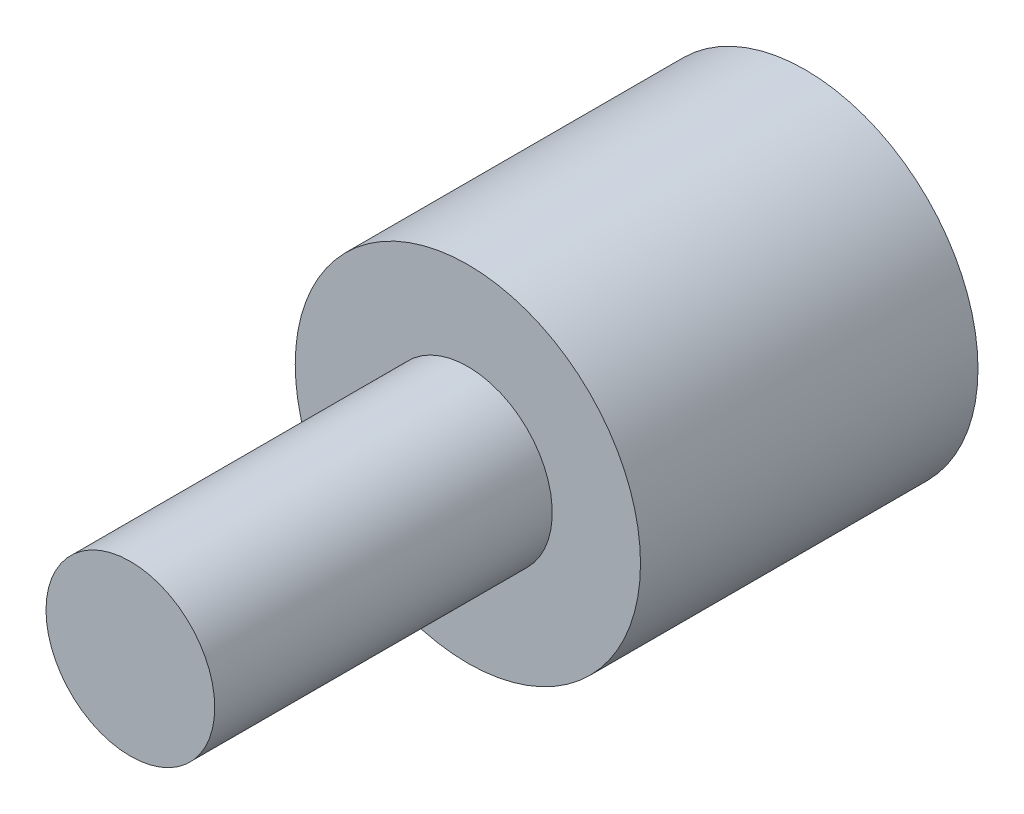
ISO-10303-21;
HEADER;
FILE_DESCRIPTION(('STEP AP214'),'2;1');
FILE_NAME('part.step','',(''),(''),'','','');
FILE_SCHEMA(('AUTOMOTIVE_DESIGN { 1 0 10303 214 1 1 1 1 }'));
ENDSEC;
DATA;
#1=APPLICATION_CONTEXT('core data for automotive mechanical design processes');
#2=APPLICATION_PROTOCOL_DEFINITION('international standard','automotive_design',2000,#1);
#3=PRODUCT_CONTEXT('',#1,'mechanical');
#4=PRODUCT('Part','Part','',(#3));
#5=PRODUCT_RELATED_PRODUCT_CATEGORY('part','',(#4));
#6=PRODUCT_DEFINITION_FORMATION('','',#4);
#7=PRODUCT_DEFINITION_CONTEXT('part definition',#1,'design');
#8=PRODUCT_DEFINITION('design','',#6,#7);
#9=PRODUCT_DEFINITION_SHAPE('','',#8);
#10=(LENGTH_UNIT() NAMED_UNIT(*) SI_UNIT(.MILLI.,.METRE.));
#11=(NAMED_UNIT(*) PLANE_ANGLE_UNIT() SI_UNIT($,.RADIAN.));
#12=(NAMED_UNIT(*) SI_UNIT($,.STERADIAN.) SOLID_ANGLE_UNIT());
#13=UNCERTAINTY_MEASURE_WITH_UNIT(LENGTH_MEASURE(1.E-05),#10,'distance_accuracy_value','');
#14=(GEOMETRIC_REPRESENTATION_CONTEXT(3) GLOBAL_UNCERTAINTY_ASSIGNED_CONTEXT((#13)) GLOBAL_UNIT_ASSIGNED_CONTEXT((#10,
#11,#12)) REPRESENTATION_CONTEXT('',''));
#15=CARTESIAN_POINT('',(0.,0.,0.));
#16=DIRECTION('',(0.,0.,1.));
#17=DIRECTION('',(1.,0.,0.));
#18=AXIS2_PLACEMENT_3D('',#15,#16,#17);
#19=CARTESIAN_POINT('',(0.,0.,10.));
#20=DIRECTION('',(0.,0.,-1.));
#21=DIRECTION('',(-1.,0.,0.));
#22=AXIS2_PLACEMENT_3D('',#19,#20,#21);
#23=CYLINDRICAL_SURFACE('',#22,2.5);
#24=CARTESIAN_POINT('',(0.,0.,10.));
#25=DIRECTION('',(0.,0.,1.));
#26=DIRECTION('',(1.,0.,0.));
#27=AXIS2_PLACEMENT_3D('',#24,#25,#26);
#28=CIRCLE('',#27,2.5);
#29=CARTESIAN_POINT('',(2.5,0.,10.));
#30=VERTEX_POINT('',#29);
#31=EDGE_CURVE('E10',#30,#30,#28,.T.);
#32=ORIENTED_EDGE('',*,*,#31,.F.);
#33=EDGE_LOOP('',(#32));
#34=FACE_BOUND('',#33,.T.);
#35=CARTESIAN_POINT('',(0.,0.,0.));
#36=DIRECTION('',(0.,0.,-1.));
#37=DIRECTION('',(-1.,0.,0.));
#38=AXIS2_PLACEMENT_3D('',#35,#36,#37);
#39=CIRCLE('',#38,2.5);
#40=CARTESIAN_POINT('',(-2.5,0.,0.));
#41=VERTEX_POINT('',#40);
#42=EDGE_CURVE('E37',#41,#41,#39,.T.);
#43=ORIENTED_EDGE('',*,*,#42,.F.);
#44=EDGE_LOOP('',(#43));
#45=FACE_BOUND('',#44,.T.);
#46=ADVANCED_FACE('F31',(#34,#45),#23,.T.);
#47=CARTESIAN_POINT('',(0.,0.,10.));
#48=DIRECTION('',(0.,0.,1.));
#49=DIRECTION('',(1.,0.,0.));
#50=AXIS2_PLACEMENT_3D('',#47,#48,#49);
#51=PLANE('',#50);
#52=ORIENTED_EDGE('',*,*,#31,.T.);
#53=EDGE_LOOP('',(#52));
#54=FACE_BOUND('',#53,.T.);
#55=ADVANCED_FACE('F55',(#54),#51,.T.);
#56=CARTESIAN_POINT('',(0.,0.,0.));
#57=DIRECTION('',(0.,0.,-1.));
#58=DIRECTION('',(-1.,0.,0.));
#59=AXIS2_PLACEMENT_3D('',#56,#57,#58);
#60=PLANE('',#59);
#61=CARTESIAN_POINT('',(0.,0.,0.));
#62=DIRECTION('',(0.,0.,-1.));
#63=DIRECTION('',(-1.,0.,0.));
#64=AXIS2_PLACEMENT_3D('',#61,#62,#63);
#65=CIRCLE('',#64,5.11525213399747);
#66=CARTESIAN_POINT('',(-5.11525213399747,0.,0.));
#67=VERTEX_POINT('',#66);
#68=EDGE_CURVE('E45',#67,#67,#65,.T.);
#69=ORIENTED_EDGE('',*,*,#68,.F.);
#70=EDGE_LOOP('',(#69));
#71=FACE_BOUND('',#70,.T.);
#72=ORIENTED_EDGE('',*,*,#42,.T.);
#73=EDGE_LOOP('',(#72));
#74=FACE_BOUND('',#73,.T.);
#75=ADVANCED_FACE('F53',(#71,#74),#60,.F.);
#76=CARTESIAN_POINT('',(0.,0.,-10.));
#77=DIRECTION('',(0.,0.,1.));
#78=DIRECTION('',(1.,0.,0.));
#79=AXIS2_PLACEMENT_3D('',#76,#77,#78);
#80=CYLINDRICAL_SURFACE('',#79,5.11525213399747);
#81=CARTESIAN_POINT('',(0.,0.,-10.));
#82=DIRECTION('',(0.,0.,-1.));
#83=DIRECTION('',(-1.,0.,0.));
#84=AXIS2_PLACEMENT_3D('',#81,#82,#83);
#85=CIRCLE('',#84,5.11525213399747);
#86=CARTESIAN_POINT('',(-5.11525213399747,0.,-10.));
#87=VERTEX_POINT('',#86);
#88=EDGE_CURVE('E41',#87,#87,#85,.T.);
#89=ORIENTED_EDGE('',*,*,#88,.F.);
#90=EDGE_LOOP('',(#89));
#91=FACE_BOUND('',#90,.T.);
#92=ORIENTED_EDGE('',*,*,#68,.T.);
#93=EDGE_LOOP('',(#92));
#94=FACE_BOUND('',#93,.T.);
#95=ADVANCED_FACE('F51',(#91,#94),#80,.T.);
#96=CARTESIAN_POINT('',(0.,0.,-10.));
#97=DIRECTION('',(0.,0.,-1.));
#98=DIRECTION('',(-1.,0.,0.));
#99=AXIS2_PLACEMENT_3D('',#96,#97,#98);
#100=PLANE('',#99);
#101=ORIENTED_EDGE('',*,*,#88,.T.);
#102=EDGE_LOOP('',(#101));
#103=FACE_BOUND('',#102,.T.);
#104=ADVANCED_FACE('F61',(#103),#100,.T.);
#105=CLOSED_SHELL('',(#46,#55,#75,#95,#104));
#106=MANIFOLD_SOLID_BREP('B2',#105);
#107=ADVANCED_BREP_SHAPE_REPRESENTATION('',(#18,#106),#14);
#108=SHAPE_DEFINITION_REPRESENTATION(#9,#107);
ENDSEC;
END-ISO-10303-21;
